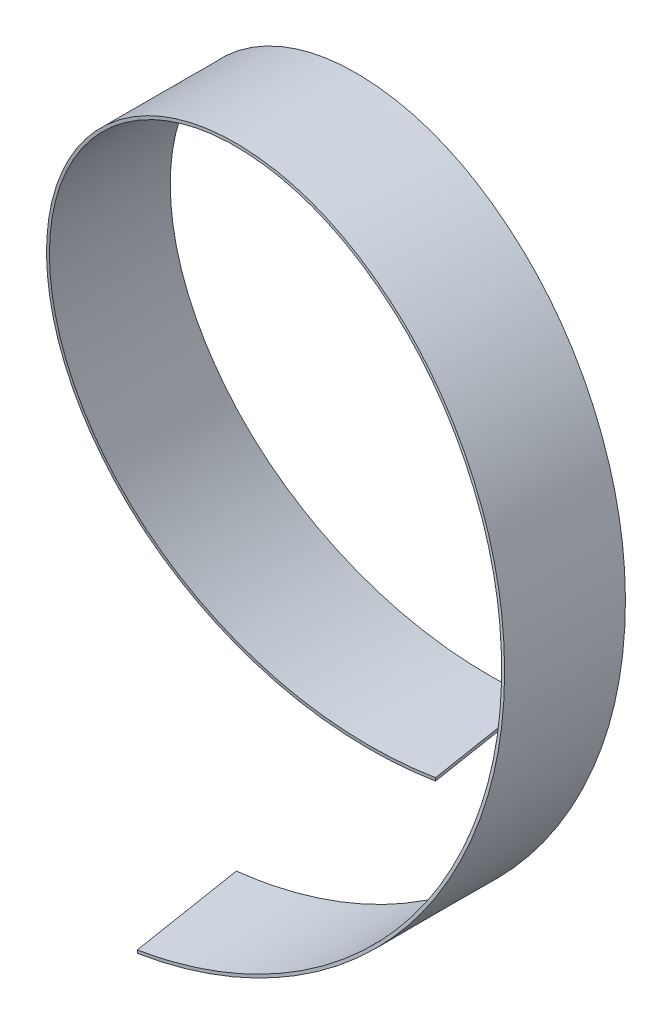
ISO-10303-21;
HEADER;
FILE_DESCRIPTION(('STEP AP214'),'2;1');
FILE_NAME('part.step','',(''),(''),'','','');
FILE_SCHEMA(('AUTOMOTIVE_DESIGN { 1 0 10303 214 1 1 1 1 }'));
ENDSEC;
DATA;
#1=APPLICATION_CONTEXT('core data for automotive mechanical design processes');
#2=APPLICATION_PROTOCOL_DEFINITION('international standard','automotive_design',2000,#1);
#3=PRODUCT_CONTEXT('',#1,'mechanical');
#4=PRODUCT('Part','Part','',(#3));
#5=PRODUCT_RELATED_PRODUCT_CATEGORY('part','',(#4));
#6=PRODUCT_DEFINITION_FORMATION('','',#4);
#7=PRODUCT_DEFINITION_CONTEXT('part definition',#1,'design');
#8=PRODUCT_DEFINITION('design','',#6,#7);
#9=PRODUCT_DEFINITION_SHAPE('','',#8);
#10=(LENGTH_UNIT() NAMED_UNIT(*) SI_UNIT(.MILLI.,.METRE.));
#11=(NAMED_UNIT(*) PLANE_ANGLE_UNIT() SI_UNIT($,.RADIAN.));
#12=(NAMED_UNIT(*) SI_UNIT($,.STERADIAN.) SOLID_ANGLE_UNIT());
#13=UNCERTAINTY_MEASURE_WITH_UNIT(LENGTH_MEASURE(1.E-05),#10,'distance_accuracy_value','');
#14=(GEOMETRIC_REPRESENTATION_CONTEXT(3) GLOBAL_UNCERTAINTY_ASSIGNED_CONTEXT((#13)) GLOBAL_UNIT_ASSIGNED_CONTEXT((#10,
#11,#12)) REPRESENTATION_CONTEXT('',''));
#15=CARTESIAN_POINT('',(0.,0.,0.));
#16=DIRECTION('',(0.,0.,1.));
#17=DIRECTION('',(1.,0.,0.));
#18=AXIS2_PLACEMENT_3D('',#15,#16,#17);
#19=CARTESIAN_POINT('',(1.5717672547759,-49.75,9.87570492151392));
#20=DIRECTION('',(0.987570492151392,0.,-0.15717672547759));
#21=DIRECTION('',(-0.15717672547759,0.,-0.987570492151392));
#22=AXIS2_PLACEMENT_3D('',#19,#20,#21);
#23=PLANE('',#22);
#24=DIRECTION('',(0.,-1.,0.));
#25=VECTOR('',#24,1.);
#26=CARTESIAN_POINT('',(1.5717672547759,-49.75,9.87570492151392));
#27=LINE('',#26,#25);
#28=CARTESIAN_POINT('',(1.5717672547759,-49.75,9.87570492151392));
#29=VERTEX_POINT('',#28);
#30=CARTESIAN_POINT('',(1.5717672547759,-50.25,9.87570492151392));
#31=VERTEX_POINT('',#30);
#32=EDGE_CURVE('E84',#29,#31,#27,.T.);
#33=ORIENTED_EDGE('',*,*,#32,.T.);
#34=DIRECTION('',(-0.15717672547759,0.,-0.987570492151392));
#35=VECTOR('',#34,1.);
#36=CARTESIAN_POINT('',(1.5717672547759,-50.25,9.87570492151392));
#37=LINE('',#36,#35);
#38=CARTESIAN_POINT('',(-1.5717672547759,-50.25,-9.87570492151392));
#39=VERTEX_POINT('',#38);
#40=EDGE_CURVE('E77',#31,#39,#37,.T.);
#41=ORIENTED_EDGE('',*,*,#40,.T.);
#42=DIRECTION('',(0.,1.,0.));
#43=VECTOR('',#42,1.);
#44=CARTESIAN_POINT('',(-1.5717672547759,-49.75,-9.87570492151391));
#45=LINE('',#44,#43);
#46=CARTESIAN_POINT('',(-1.5717672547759,-49.75,-9.87570492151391));
#47=VERTEX_POINT('',#46);
#48=EDGE_CURVE('E72',#39,#47,#45,.T.);
#49=ORIENTED_EDGE('',*,*,#48,.T.);
#50=DIRECTION('',(0.15717672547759,0.,0.987570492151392));
#51=VECTOR('',#50,1.);
#52=CARTESIAN_POINT('',(1.5717672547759,-49.75,9.87570492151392));
#53=LINE('',#52,#51);
#54=EDGE_CURVE('E67',#47,#29,#53,.T.);
#55=ORIENTED_EDGE('',*,*,#54,.T.);
#56=EDGE_LOOP('',(#33,#41,#49,#55));
#57=FACE_BOUND('',#56,.T.);
#58=ADVANCED_FACE('F32',(#57),#23,.T.);
#59=CARTESIAN_POINT('',(1.57176725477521,-49.75,59.8757049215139));
#60=DIRECTION('',(0.987570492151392,0.,-0.15717672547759));
#61=DIRECTION('',(-0.15717672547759,0.,-0.987570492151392));
#62=AXIS2_PLACEMENT_3D('',#59,#60,#61);
#63=PLANE('',#62);
#64=DIRECTION('',(0.,-1.,0.));
#65=VECTOR('',#64,1.);
#66=CARTESIAN_POINT('',(1.57176725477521,-49.75,59.8757049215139));
#67=LINE('',#66,#65);
#68=CARTESIAN_POINT('',(1.57176725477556,-49.75,59.8757049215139));
#69=VERTEX_POINT('',#68);
#70=CARTESIAN_POINT('',(1.57176725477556,-50.25,59.8757049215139));
#71=VERTEX_POINT('',#70);
#72=EDGE_CURVE('E92',#69,#71,#67,.T.);
#73=ORIENTED_EDGE('',*,*,#72,.F.);
#74=DIRECTION('',(0.15717672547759,0.,0.987570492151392));
#75=VECTOR('',#74,1.);
#76=CARTESIAN_POINT('',(1.57176725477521,-49.75,59.8757049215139));
#77=LINE('',#76,#75);
#78=CARTESIAN_POINT('',(-1.57176725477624,-49.75,40.124295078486));
#79=VERTEX_POINT('',#78);
#80=EDGE_CURVE('E11',#79,#69,#77,.T.);
#81=ORIENTED_EDGE('',*,*,#80,.F.);
#82=DIRECTION('',(0.,1.,0.));
#83=VECTOR('',#82,1.);
#84=CARTESIAN_POINT('',(-1.5717672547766,-49.75,40.1242950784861));
#85=LINE('',#84,#83);
#86=CARTESIAN_POINT('',(-1.57176725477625,-50.25,40.124295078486));
#87=VERTEX_POINT('',#86);
#88=EDGE_CURVE('E46',#87,#79,#85,.T.);
#89=ORIENTED_EDGE('',*,*,#88,.F.);
#90=DIRECTION('',(-0.15717672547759,0.,-0.987570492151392));
#91=VECTOR('',#90,1.);
#92=CARTESIAN_POINT('',(1.5717672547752,-50.25,59.8757049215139));
#93=LINE('',#92,#91);
#94=EDGE_CURVE('E55',#71,#87,#93,.T.);
#95=ORIENTED_EDGE('',*,*,#94,.F.);
#96=EDGE_LOOP('',(#73,#81,#89,#95));
#97=FACE_BOUND('',#96,.T.);
#98=ADVANCED_FACE('F146',(#97),#63,.F.);
#99=CARTESIAN_POINT('',(1.5717672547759,-49.75,9.87570492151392));
#100=CARTESIAN_POINT('',(-11.7587050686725,-50.1711537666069,11.9590382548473));
#101=CARTESIAN_POINT('',(-23.5138096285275,-43.8706474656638,14.0423715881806));
#102=CARTESIAN_POINT('',(-35.2689141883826,-37.5701411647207,16.1257049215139));
#103=CARTESIAN_POINT('',(-42.2988802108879,-26.2361903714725,18.2090382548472));
#104=CARTESIAN_POINT('',(-49.3288462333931,-14.9022395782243,20.2923715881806));
#105=CARTESIAN_POINT('',(-49.75,-1.57176725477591,22.3757049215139));
#106=CARTESIAN_POINT('',(-50.1711537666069,11.7587050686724,24.4590382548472));
#107=CARTESIAN_POINT('',(-43.8706474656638,23.5138096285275,26.5423715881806));
#108=CARTESIAN_POINT('',(-37.5701411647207,35.2689141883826,28.6257049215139));
#109=CARTESIAN_POINT('',(-26.2361903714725,42.2988802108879,30.7090382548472));
#110=CARTESIAN_POINT('',(-14.9022395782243,49.3288462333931,32.7923715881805));
#111=CARTESIAN_POINT('',(-1.57176725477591,49.75,34.8757049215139));
#112=CARTESIAN_POINT('',(11.7587050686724,50.1711537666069,36.9590382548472));
#113=CARTESIAN_POINT('',(23.5138096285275,43.8706474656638,39.0423715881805));
#114=CARTESIAN_POINT('',(35.2689141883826,37.5701411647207,41.1257049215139));
#115=CARTESIAN_POINT('',(42.2988802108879,26.2361903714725,43.2090382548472));
#116=CARTESIAN_POINT('',(49.3288462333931,14.9022395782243,45.2923715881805));
#117=CARTESIAN_POINT('',(49.75,1.57176725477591,47.3757049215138));
#118=CARTESIAN_POINT('',(50.1711537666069,-11.7587050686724,49.4590382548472));
#119=CARTESIAN_POINT('',(43.8706474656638,-23.5138096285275,51.5423715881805));
#120=CARTESIAN_POINT('',(37.5701411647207,-35.2689141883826,53.6257049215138));
#121=CARTESIAN_POINT('',(26.2361903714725,-42.2988802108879,55.7090382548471));
#122=CARTESIAN_POINT('',(14.9022395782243,-49.3288462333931,57.7923715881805));
#123=CARTESIAN_POINT('',(1.5717672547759,-49.75,59.8757049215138));
#124=CARTESIAN_POINT('',(1.5717672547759,-50.25,9.87570492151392));
#125=CARTESIAN_POINT('',(-11.892679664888,-50.6711537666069,11.9590382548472));
#126=CARTESIAN_POINT('',(-23.7638096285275,-44.303660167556,14.0423715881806));
#127=CARTESIAN_POINT('',(-35.6349395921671,-37.9361665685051,16.1257049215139));
#128=CARTESIAN_POINT('',(-42.7318929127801,-26.4861903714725,18.2090382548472));
#129=CARTESIAN_POINT('',(-49.8288462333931,-15.0362141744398,20.2923715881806));
#130=CARTESIAN_POINT('',(-50.25,-1.57176725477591,22.3757049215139));
#131=CARTESIAN_POINT('',(-50.6711537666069,11.892679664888,24.4590382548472));
#132=CARTESIAN_POINT('',(-44.303660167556,23.7638096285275,26.5423715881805));
#133=CARTESIAN_POINT('',(-37.9361665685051,35.6349395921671,28.6257049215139));
#134=CARTESIAN_POINT('',(-26.4861903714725,42.7318929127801,30.7090382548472));
#135=CARTESIAN_POINT('',(-15.0362141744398,49.8288462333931,32.7923715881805));
#136=CARTESIAN_POINT('',(-1.57176725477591,50.25,34.8757049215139));
#137=CARTESIAN_POINT('',(11.892679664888,50.6711537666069,36.9590382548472));
#138=CARTESIAN_POINT('',(23.7638096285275,44.303660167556,39.0423715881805));
#139=CARTESIAN_POINT('',(35.6349395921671,37.9361665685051,41.1257049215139));
#140=CARTESIAN_POINT('',(42.7318929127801,26.4861903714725,43.2090382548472));
#141=CARTESIAN_POINT('',(49.8288462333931,15.0362141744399,45.2923715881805));
#142=CARTESIAN_POINT('',(50.25,1.57176725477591,47.3757049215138));
#143=CARTESIAN_POINT('',(50.6711537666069,-11.892679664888,49.4590382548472));
#144=CARTESIAN_POINT('',(44.303660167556,-23.7638096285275,51.5423715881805));
#145=CARTESIAN_POINT('',(37.9361665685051,-35.6349395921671,53.6257049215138));
#146=CARTESIAN_POINT('',(26.4861903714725,-42.7318929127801,55.7090382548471));
#147=CARTESIAN_POINT('',(15.0362141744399,-49.8288462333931,57.7923715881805));
#148=CARTESIAN_POINT('',(1.5717672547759,-50.25,59.8757049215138));
#149=(BOUNDED_SURFACE() B_SPLINE_SURFACE(1,2,((#99,#100,#101,#102,#103,#104,#105,#106,#107,#108,
#109,#110,#111,#112,#113,#114,#115,#116,#117,#118,#119,#120,#121,#122,#123),(#124,#125,#126,
#127,#128,#129,#130,#131,#132,#133,#134,#135,#136,#137,#138,#139,#140,#141,#142,#143,#144,#145,
#146,#147,#148)),.UNSPECIFIED.,.F.,.F.,.F.) B_SPLINE_SURFACE_WITH_KNOTS((2,2),(3,2,2,2,2,2,2,2,
2,2,2,2,3),(0.,1.),(0.,0.0833333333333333,0.166666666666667,0.25,0.333333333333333,
0.416666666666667,0.5,0.583333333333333,0.666666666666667,0.75,0.833333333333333,
0.916666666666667,1.),
.UNSPECIFIED.) GEOMETRIC_REPRESENTATION_ITEM() RATIONAL_B_SPLINE_SURFACE(((1.,0.965925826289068,
1.,0.965925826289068,1.,0.965925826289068,1.,0.965925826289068,1.,0.965925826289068,1.,
0.965925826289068,1.,0.965925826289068,1.,0.965925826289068,1.,0.965925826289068,1.,
0.965925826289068,1.,0.965925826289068,1.,0.965925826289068,1.),(1.,0.965925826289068,1.,
0.965925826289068,1.,0.965925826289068,1.,0.965925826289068,1.,0.965925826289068,1.,
0.965925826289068,1.,0.965925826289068,1.,0.965925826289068,1.,0.965925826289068,1.,
0.965925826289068,1.,0.965925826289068,1.,0.965925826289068,1.))) REPRESENTATION_ITEM('') SURFACE());
#150=CARTESIAN_POINT('',(1.5717672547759,-50.25,9.87570492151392));
#151=CARTESIAN_POINT('',(-11.892679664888,-50.6711537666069,11.9590382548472));
#152=CARTESIAN_POINT('',(-23.7638096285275,-44.303660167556,14.0423715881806));
#153=CARTESIAN_POINT('',(-35.6349395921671,-37.9361665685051,16.1257049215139));
#154=CARTESIAN_POINT('',(-42.7318929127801,-26.4861903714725,18.2090382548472));
#155=CARTESIAN_POINT('',(-49.8288462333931,-15.0362141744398,20.2923715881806));
#156=CARTESIAN_POINT('',(-50.25,-1.57176725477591,22.3757049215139));
#157=CARTESIAN_POINT('',(-50.6711537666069,11.892679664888,24.4590382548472));
#158=CARTESIAN_POINT('',(-44.303660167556,23.7638096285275,26.5423715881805));
#159=CARTESIAN_POINT('',(-37.9361665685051,35.6349395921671,28.6257049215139));
#160=CARTESIAN_POINT('',(-26.4861903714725,42.7318929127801,30.7090382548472));
#161=CARTESIAN_POINT('',(-15.0362141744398,49.8288462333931,32.7923715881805));
#162=CARTESIAN_POINT('',(-1.57176725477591,50.25,34.8757049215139));
#163=CARTESIAN_POINT('',(11.892679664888,50.6711537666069,36.9590382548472));
#164=CARTESIAN_POINT('',(23.7638096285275,44.303660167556,39.0423715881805));
#165=CARTESIAN_POINT('',(35.6349395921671,37.9361665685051,41.1257049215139));
#166=CARTESIAN_POINT('',(42.7318929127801,26.4861903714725,43.2090382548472));
#167=CARTESIAN_POINT('',(49.8288462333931,15.0362141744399,45.2923715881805));
#168=CARTESIAN_POINT('',(50.25,1.57176725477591,47.3757049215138));
#169=CARTESIAN_POINT('',(50.6711537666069,-11.892679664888,49.4590382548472));
#170=CARTESIAN_POINT('',(44.303660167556,-23.7638096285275,51.5423715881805));
#171=CARTESIAN_POINT('',(37.9361665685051,-35.6349395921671,53.6257049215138));
#172=CARTESIAN_POINT('',(26.4861903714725,-42.7318929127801,55.7090382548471));
#173=CARTESIAN_POINT('',(15.0362141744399,-49.8288462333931,57.7923715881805));
#174=CARTESIAN_POINT('',(1.57176725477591,-50.25,59.8757049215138));
#175=(BOUNDED_CURVE() B_SPLINE_CURVE(2,(#150,#151,#152,#153,#154,#155,#156,#157,#158,#159,#160,
#161,#162,#163,#164,#165,#166,#167,#168,#169,#170,#171,#172,#173,#174),.UNSPECIFIED.,.F.,
.F.) B_SPLINE_CURVE_WITH_KNOTS((3,2,2,2,2,2,2,2,2,2,2,2,3),(0.,0.0833333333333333,
0.166666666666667,0.25,0.333333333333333,0.416666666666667,0.5,0.583333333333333,
0.666666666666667,0.75,0.833333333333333,0.916666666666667,1.),
.UNSPECIFIED.) CURVE() GEOMETRIC_REPRESENTATION_ITEM() RATIONAL_B_SPLINE_CURVE((1.,
0.965925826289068,1.,0.965925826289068,1.,0.965925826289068,1.,0.965925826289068,1.,
0.965925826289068,1.,0.965925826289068,1.,0.965925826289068,1.,0.965925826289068,1.,
0.965925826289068,1.,0.965925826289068,1.,0.965925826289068,1.,0.965925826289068,1.)) REPRESENTATION_ITEM(''));
#176=EDGE_CURVE('E87',#31,#71,#175,.T.);
#177=CARTESIAN_POINT('',(1.5717672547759,-49.75,9.87570492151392));
#178=CARTESIAN_POINT('',(-11.7587050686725,-50.1711537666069,11.9590382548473));
#179=CARTESIAN_POINT('',(-23.5138096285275,-43.8706474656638,14.0423715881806));
#180=CARTESIAN_POINT('',(-35.2689141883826,-37.5701411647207,16.1257049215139));
#181=CARTESIAN_POINT('',(-42.2988802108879,-26.2361903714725,18.2090382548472));
#182=CARTESIAN_POINT('',(-49.3288462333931,-14.9022395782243,20.2923715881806));
#183=CARTESIAN_POINT('',(-49.75,-1.57176725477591,22.3757049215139));
#184=CARTESIAN_POINT('',(-50.1711537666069,11.7587050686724,24.4590382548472));
#185=CARTESIAN_POINT('',(-43.8706474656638,23.5138096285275,26.5423715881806));
#186=CARTESIAN_POINT('',(-37.5701411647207,35.2689141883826,28.6257049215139));
#187=CARTESIAN_POINT('',(-26.2361903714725,42.2988802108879,30.7090382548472));
#188=CARTESIAN_POINT('',(-14.9022395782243,49.3288462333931,32.7923715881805));
#189=CARTESIAN_POINT('',(-1.57176725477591,49.75,34.8757049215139));
#190=CARTESIAN_POINT('',(11.7587050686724,50.1711537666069,36.9590382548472));
#191=CARTESIAN_POINT('',(23.5138096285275,43.8706474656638,39.0423715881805));
#192=CARTESIAN_POINT('',(35.2689141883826,37.5701411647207,41.1257049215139));
#193=CARTESIAN_POINT('',(42.2988802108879,26.2361903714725,43.2090382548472));
#194=CARTESIAN_POINT('',(49.3288462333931,14.9022395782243,45.2923715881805));
#195=CARTESIAN_POINT('',(49.75,1.57176725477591,47.3757049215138));
#196=CARTESIAN_POINT('',(50.1711537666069,-11.7587050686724,49.4590382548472));
#197=CARTESIAN_POINT('',(43.8706474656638,-23.5138096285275,51.5423715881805));
#198=CARTESIAN_POINT('',(37.5701411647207,-35.2689141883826,53.6257049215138));
#199=CARTESIAN_POINT('',(26.2361903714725,-42.2988802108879,55.7090382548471));
#200=CARTESIAN_POINT('',(14.9022395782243,-49.3288462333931,57.7923715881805));
#201=CARTESIAN_POINT('',(1.57176725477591,-49.75,59.8757049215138));
#202=(BOUNDED_CURVE() B_SPLINE_CURVE(2,(#177,#178,#179,#180,#181,#182,#183,#184,#185,#186,#187,
#188,#189,#190,#191,#192,#193,#194,#195,#196,#197,#198,#199,#200,#201),.UNSPECIFIED.,.F.,
.F.) B_SPLINE_CURVE_WITH_KNOTS((3,2,2,2,2,2,2,2,2,2,2,2,3),(0.,0.0833333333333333,
0.166666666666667,0.25,0.333333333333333,0.416666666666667,0.5,0.583333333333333,
0.666666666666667,0.75,0.833333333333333,0.916666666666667,1.),
.UNSPECIFIED.) CURVE() GEOMETRIC_REPRESENTATION_ITEM() RATIONAL_B_SPLINE_CURVE((1.,
0.965925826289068,1.,0.965925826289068,1.,0.965925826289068,1.,0.965925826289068,1.,
0.965925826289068,1.,0.965925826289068,1.,0.965925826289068,1.,0.965925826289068,1.,
0.965925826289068,1.,0.965925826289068,1.,0.965925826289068,1.,0.965925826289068,1.)) REPRESENTATION_ITEM(''));
#203=EDGE_CURVE('E86',#29,#69,#202,.T.);
#204=ORIENTED_EDGE('',*,*,#176,.F.);
#205=ORIENTED_EDGE('',*,*,#32,.F.);
#206=ORIENTED_EDGE('',*,*,#203,.T.);
#207=ORIENTED_EDGE('',*,*,#72,.T.);
#208=EDGE_LOOP('',(#204,#205,#206,#207));
#209=FACE_BOUND('',#208,.T.);
#210=ADVANCED_FACE('F85',(#209),#149,.F.);
#211=CARTESIAN_POINT('',(1.5717672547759,-50.25,9.87570492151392));
#212=CARTESIAN_POINT('',(-11.892679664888,-50.6711537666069,11.9590382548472));
#213=CARTESIAN_POINT('',(-23.7638096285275,-44.303660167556,14.0423715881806));
#214=CARTESIAN_POINT('',(-35.6349395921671,-37.9361665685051,16.1257049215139));
#215=CARTESIAN_POINT('',(-42.7318929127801,-26.4861903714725,18.2090382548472));
#216=CARTESIAN_POINT('',(-49.8288462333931,-15.0362141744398,20.2923715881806));
#217=CARTESIAN_POINT('',(-50.25,-1.57176725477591,22.3757049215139));
#218=CARTESIAN_POINT('',(-50.6711537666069,11.892679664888,24.4590382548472));
#219=CARTESIAN_POINT('',(-44.303660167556,23.7638096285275,26.5423715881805));
#220=CARTESIAN_POINT('',(-37.9361665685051,35.6349395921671,28.6257049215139));
#221=CARTESIAN_POINT('',(-26.4861903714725,42.7318929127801,30.7090382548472));
#222=CARTESIAN_POINT('',(-15.0362141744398,49.8288462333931,32.7923715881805));
#223=CARTESIAN_POINT('',(-1.57176725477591,50.25,34.8757049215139));
#224=CARTESIAN_POINT('',(11.892679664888,50.6711537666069,36.9590382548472));
#225=CARTESIAN_POINT('',(23.7638096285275,44.303660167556,39.0423715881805));
#226=CARTESIAN_POINT('',(35.6349395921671,37.9361665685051,41.1257049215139));
#227=CARTESIAN_POINT('',(42.7318929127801,26.4861903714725,43.2090382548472));
#228=CARTESIAN_POINT('',(49.8288462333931,15.0362141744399,45.2923715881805));
#229=CARTESIAN_POINT('',(50.25,1.57176725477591,47.3757049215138));
#230=CARTESIAN_POINT('',(50.6711537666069,-11.892679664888,49.4590382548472));
#231=CARTESIAN_POINT('',(44.303660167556,-23.7638096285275,51.5423715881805));
#232=CARTESIAN_POINT('',(37.9361665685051,-35.6349395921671,53.6257049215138));
#233=CARTESIAN_POINT('',(26.4861903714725,-42.7318929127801,55.7090382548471));
#234=CARTESIAN_POINT('',(15.0362141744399,-49.8288462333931,57.7923715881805));
#235=CARTESIAN_POINT('',(1.5717672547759,-50.25,59.8757049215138));
#236=CARTESIAN_POINT('',(-1.5717672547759,-50.25,-9.87570492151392));
#237=CARTESIAN_POINT('',(-15.0362141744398,-49.8288462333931,-7.79237158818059));
#238=CARTESIAN_POINT('',(-26.4861903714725,-42.7318929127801,-5.70903825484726));
#239=CARTESIAN_POINT('',(-37.9361665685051,-35.6349395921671,-3.62570492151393));
#240=CARTESIAN_POINT('',(-44.303660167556,-23.7638096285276,-1.54237158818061));
#241=CARTESIAN_POINT('',(-50.6711537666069,-11.892679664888,0.540961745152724));
#242=CARTESIAN_POINT('',(-50.25,1.5717672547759,2.62429507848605));
#243=CARTESIAN_POINT('',(-49.8288462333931,15.0362141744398,4.70762841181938));
#244=CARTESIAN_POINT('',(-42.7318929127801,26.4861903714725,6.79096174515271));
#245=CARTESIAN_POINT('',(-35.6349395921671,37.9361665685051,8.87429507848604));
#246=CARTESIAN_POINT('',(-23.7638096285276,44.303660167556,10.9576284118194));
#247=CARTESIAN_POINT('',(-11.892679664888,50.6711537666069,13.0409617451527));
#248=CARTESIAN_POINT('',(1.5717672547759,50.25,15.124295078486));
#249=CARTESIAN_POINT('',(15.0362141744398,49.8288462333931,17.2076284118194));
#250=CARTESIAN_POINT('',(26.4861903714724,42.7318929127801,19.2909617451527));
#251=CARTESIAN_POINT('',(37.9361665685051,35.6349395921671,21.374295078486));
#252=CARTESIAN_POINT('',(44.303660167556,23.7638096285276,23.4576284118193));
#253=CARTESIAN_POINT('',(50.6711537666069,11.8926796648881,25.5409617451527));
#254=CARTESIAN_POINT('',(50.25,-1.57176725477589,27.624295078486));
#255=CARTESIAN_POINT('',(49.8288462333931,-15.0362141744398,29.7076284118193));
#256=CARTESIAN_POINT('',(42.7318929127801,-26.4861903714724,31.7909617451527));
#257=CARTESIAN_POINT('',(35.6349395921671,-37.9361665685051,33.874295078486));
#258=CARTESIAN_POINT('',(23.7638096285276,-44.303660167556,35.9576284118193));
#259=CARTESIAN_POINT('',(11.8926796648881,-50.6711537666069,38.0409617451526));
#260=CARTESIAN_POINT('',(-1.5717672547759,-50.25,40.124295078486));
#261=(BOUNDED_SURFACE() B_SPLINE_SURFACE(1,2,((#211,#212,#213,#214,#215,#216,#217,#218,#219,
#220,#221,#222,#223,#224,#225,#226,#227,#228,#229,#230,#231,#232,#233,#234,#235),(#236,#237,
#238,#239,#240,#241,#242,#243,#244,#245,#246,#247,#248,#249,#250,#251,#252,#253,#254,#255,#256,
#257,#258,#259,#260)),.UNSPECIFIED.,.F.,.F.,.F.) B_SPLINE_SURFACE_WITH_KNOTS((2,2),(3,2,2,2,2,2,
2,2,2,2,2,2,3),(0.,1.),(0.,0.0833333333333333,0.166666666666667,0.25,0.333333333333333,
0.416666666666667,0.5,0.583333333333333,0.666666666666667,0.75,0.833333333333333,
0.916666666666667,1.),
.UNSPECIFIED.) GEOMETRIC_REPRESENTATION_ITEM() RATIONAL_B_SPLINE_SURFACE(((1.,0.965925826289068,
1.,0.965925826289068,1.,0.965925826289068,1.,0.965925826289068,1.,0.965925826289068,1.,
0.965925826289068,1.,0.965925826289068,1.,0.965925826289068,1.,0.965925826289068,1.,
0.965925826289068,1.,0.965925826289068,1.,0.965925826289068,1.),(1.,0.965925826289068,1.,
0.965925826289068,1.,0.965925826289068,1.,0.965925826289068,1.,0.965925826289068,1.,
0.965925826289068,1.,0.965925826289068,1.,0.965925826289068,1.,0.965925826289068,1.,
0.965925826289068,1.,0.965925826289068,1.,0.965925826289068,1.))) REPRESENTATION_ITEM('') SURFACE());
#262=CARTESIAN_POINT('',(-1.5717672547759,-50.25,-9.87570492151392));
#263=CARTESIAN_POINT('',(-15.0362141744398,-49.8288462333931,-7.79237158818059));
#264=CARTESIAN_POINT('',(-26.4861903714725,-42.7318929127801,-5.70903825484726));
#265=CARTESIAN_POINT('',(-37.9361665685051,-35.6349395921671,-3.62570492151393));
#266=CARTESIAN_POINT('',(-44.303660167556,-23.7638096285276,-1.5423715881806));
#267=CARTESIAN_POINT('',(-50.6711537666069,-11.892679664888,0.540961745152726));
#268=CARTESIAN_POINT('',(-50.25,1.5717672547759,2.62429507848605));
#269=CARTESIAN_POINT('',(-49.8288462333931,15.0362141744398,4.70762841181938));
#270=CARTESIAN_POINT('',(-42.7318929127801,26.4861903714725,6.79096174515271));
#271=CARTESIAN_POINT('',(-35.6349395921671,37.9361665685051,8.87429507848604));
#272=CARTESIAN_POINT('',(-23.7638096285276,44.303660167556,10.9576284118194));
#273=CARTESIAN_POINT('',(-11.892679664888,50.6711537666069,13.0409617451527));
#274=CARTESIAN_POINT('',(1.5717672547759,50.25,15.124295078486));
#275=CARTESIAN_POINT('',(15.0362141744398,49.8288462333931,17.2076284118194));
#276=CARTESIAN_POINT('',(26.4861903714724,42.7318929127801,19.2909617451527));
#277=CARTESIAN_POINT('',(37.9361665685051,35.6349395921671,21.374295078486));
#278=CARTESIAN_POINT('',(44.303660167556,23.7638096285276,23.4576284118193));
#279=CARTESIAN_POINT('',(50.6711537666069,11.8926796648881,25.5409617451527));
#280=CARTESIAN_POINT('',(50.25,-1.57176725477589,27.624295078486));
#281=CARTESIAN_POINT('',(49.8288462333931,-15.0362141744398,29.7076284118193));
#282=CARTESIAN_POINT('',(42.7318929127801,-26.4861903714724,31.7909617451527));
#283=CARTESIAN_POINT('',(35.6349395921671,-37.9361665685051,33.874295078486));
#284=CARTESIAN_POINT('',(23.7638096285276,-44.303660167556,35.9576284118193));
#285=CARTESIAN_POINT('',(11.8926796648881,-50.6711537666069,38.0409617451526));
#286=CARTESIAN_POINT('',(-1.57176725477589,-50.25,40.124295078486));
#287=(BOUNDED_CURVE() B_SPLINE_CURVE(2,(#262,#263,#264,#265,#266,#267,#268,#269,#270,#271,#272,
#273,#274,#275,#276,#277,#278,#279,#280,#281,#282,#283,#284,#285,#286),.UNSPECIFIED.,.F.,
.F.) B_SPLINE_CURVE_WITH_KNOTS((3,2,2,2,2,2,2,2,2,2,2,2,3),(0.,0.0833333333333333,
0.166666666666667,0.25,0.333333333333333,0.416666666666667,0.5,0.583333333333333,
0.666666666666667,0.75,0.833333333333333,0.916666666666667,1.),
.UNSPECIFIED.) CURVE() GEOMETRIC_REPRESENTATION_ITEM() RATIONAL_B_SPLINE_CURVE((1.,
0.965925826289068,1.,0.965925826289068,1.,0.965925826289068,1.,0.965925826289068,1.,
0.965925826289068,1.,0.965925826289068,1.,0.965925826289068,1.,0.965925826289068,1.,
0.965925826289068,1.,0.965925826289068,1.,0.965925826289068,1.,0.965925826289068,1.)) REPRESENTATION_ITEM(''));
#288=EDGE_CURVE('E107',#39,#87,#287,.T.);
#289=ORIENTED_EDGE('',*,*,#288,.F.);
#290=ORIENTED_EDGE('',*,*,#40,.F.);
#291=ORIENTED_EDGE('',*,*,#176,.T.);
#292=ORIENTED_EDGE('',*,*,#94,.T.);
#293=EDGE_LOOP('',(#289,#290,#291,#292));
#294=FACE_BOUND('',#293,.T.);
#295=ADVANCED_FACE('F125',(#294),#261,.F.);
#296=CARTESIAN_POINT('',(-1.5717672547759,-50.25,-9.87570492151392));
#297=CARTESIAN_POINT('',(-15.0362141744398,-49.8288462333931,-7.79237158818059));
#298=CARTESIAN_POINT('',(-26.4861903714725,-42.7318929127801,-5.70903825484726));
#299=CARTESIAN_POINT('',(-37.9361665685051,-35.6349395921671,-3.62570492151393));
#300=CARTESIAN_POINT('',(-44.303660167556,-23.7638096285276,-1.5423715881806));
#301=CARTESIAN_POINT('',(-50.6711537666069,-11.892679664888,0.540961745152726));
#302=CARTESIAN_POINT('',(-50.25,1.5717672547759,2.62429507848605));
#303=CARTESIAN_POINT('',(-49.8288462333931,15.0362141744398,4.70762841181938));
#304=CARTESIAN_POINT('',(-42.7318929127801,26.4861903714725,6.79096174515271));
#305=CARTESIAN_POINT('',(-35.6349395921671,37.9361665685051,8.87429507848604));
#306=CARTESIAN_POINT('',(-23.7638096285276,44.303660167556,10.9576284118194));
#307=CARTESIAN_POINT('',(-11.892679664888,50.6711537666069,13.0409617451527));
#308=CARTESIAN_POINT('',(1.5717672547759,50.25,15.124295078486));
#309=CARTESIAN_POINT('',(15.0362141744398,49.8288462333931,17.2076284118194));
#310=CARTESIAN_POINT('',(26.4861903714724,42.7318929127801,19.2909617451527));
#311=CARTESIAN_POINT('',(37.9361665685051,35.6349395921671,21.374295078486));
#312=CARTESIAN_POINT('',(44.303660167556,23.7638096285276,23.4576284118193));
#313=CARTESIAN_POINT('',(50.6711537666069,11.8926796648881,25.5409617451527));
#314=CARTESIAN_POINT('',(50.25,-1.57176725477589,27.624295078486));
#315=CARTESIAN_POINT('',(49.8288462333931,-15.0362141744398,29.7076284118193));
#316=CARTESIAN_POINT('',(42.7318929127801,-26.4861903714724,31.7909617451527));
#317=CARTESIAN_POINT('',(35.6349395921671,-37.9361665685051,33.874295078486));
#318=CARTESIAN_POINT('',(23.7638096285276,-44.303660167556,35.9576284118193));
#319=CARTESIAN_POINT('',(11.8926796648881,-50.6711537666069,38.0409617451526));
#320=CARTESIAN_POINT('',(-1.5717672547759,-50.25,40.124295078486));
#321=CARTESIAN_POINT('',(-1.5717672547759,-49.75,-9.87570492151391));
#322=CARTESIAN_POINT('',(-14.9022395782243,-49.3288462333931,-7.79237158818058));
#323=CARTESIAN_POINT('',(-26.2361903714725,-42.2988802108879,-5.70903825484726));
#324=CARTESIAN_POINT('',(-37.5701411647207,-35.2689141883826,-3.62570492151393));
#325=CARTESIAN_POINT('',(-43.8706474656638,-23.5138096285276,-1.5423715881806));
#326=CARTESIAN_POINT('',(-50.1711537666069,-11.7587050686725,0.540961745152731));
#327=CARTESIAN_POINT('',(-49.75,1.5717672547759,2.62429507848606));
#328=CARTESIAN_POINT('',(-49.3288462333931,14.9022395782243,4.70762841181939));
#329=CARTESIAN_POINT('',(-42.2988802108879,26.2361903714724,6.79096174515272));
#330=CARTESIAN_POINT('',(-35.2689141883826,37.5701411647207,8.87429507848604));
#331=CARTESIAN_POINT('',(-23.5138096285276,43.8706474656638,10.9576284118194));
#332=CARTESIAN_POINT('',(-11.7587050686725,50.1711537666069,13.0409617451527));
#333=CARTESIAN_POINT('',(1.57176725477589,49.75,15.124295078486));
#334=CARTESIAN_POINT('',(14.9022395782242,49.3288462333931,17.2076284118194));
#335=CARTESIAN_POINT('',(26.2361903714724,42.2988802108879,19.2909617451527));
#336=CARTESIAN_POINT('',(37.5701411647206,35.2689141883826,21.374295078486));
#337=CARTESIAN_POINT('',(43.8706474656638,23.5138096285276,23.4576284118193));
#338=CARTESIAN_POINT('',(50.1711537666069,11.7587050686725,25.5409617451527));
#339=CARTESIAN_POINT('',(49.75,-1.57176725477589,27.624295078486));
#340=CARTESIAN_POINT('',(49.3288462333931,-14.9022395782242,29.7076284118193));
#341=CARTESIAN_POINT('',(42.2988802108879,-26.2361903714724,31.7909617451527));
#342=CARTESIAN_POINT('',(35.2689141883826,-37.5701411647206,33.874295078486));
#343=CARTESIAN_POINT('',(23.5138096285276,-43.8706474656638,35.9576284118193));
#344=CARTESIAN_POINT('',(11.7587050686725,-50.1711537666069,38.0409617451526));
#345=CARTESIAN_POINT('',(-1.5717672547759,-49.75,40.124295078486));
#346=(BOUNDED_SURFACE() B_SPLINE_SURFACE(1,2,((#296,#297,#298,#299,#300,#301,#302,#303,#304,
#305,#306,#307,#308,#309,#310,#311,#312,#313,#314,#315,#316,#317,#318,#319,#320),(#321,#322,
#323,#324,#325,#326,#327,#328,#329,#330,#331,#332,#333,#334,#335,#336,#337,#338,#339,#340,#341,
#342,#343,#344,#345)),.UNSPECIFIED.,.F.,.F.,.F.) B_SPLINE_SURFACE_WITH_KNOTS((2,2),(3,2,2,2,2,2,
2,2,2,2,2,2,3),(0.,1.),(0.,0.0833333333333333,0.166666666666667,0.25,0.333333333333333,
0.416666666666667,0.5,0.583333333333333,0.666666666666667,0.75,0.833333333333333,
0.916666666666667,1.),
.UNSPECIFIED.) GEOMETRIC_REPRESENTATION_ITEM() RATIONAL_B_SPLINE_SURFACE(((1.,0.965925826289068,
1.,0.965925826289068,1.,0.965925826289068,1.,0.965925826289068,1.,0.965925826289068,1.,
0.965925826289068,1.,0.965925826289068,1.,0.965925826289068,1.,0.965925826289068,1.,
0.965925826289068,1.,0.965925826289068,1.,0.965925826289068,1.),(1.,0.965925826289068,1.,
0.965925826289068,1.,0.965925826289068,1.,0.965925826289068,1.,0.965925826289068,1.,
0.965925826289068,1.,0.965925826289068,1.,0.965925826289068,1.,0.965925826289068,1.,
0.965925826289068,1.,0.965925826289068,1.,0.965925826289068,1.))) REPRESENTATION_ITEM('') SURFACE());
#347=CARTESIAN_POINT('',(-1.5717672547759,-49.75,-9.87570492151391));
#348=CARTESIAN_POINT('',(-14.9022395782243,-49.3288462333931,-7.79237158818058));
#349=CARTESIAN_POINT('',(-26.2361903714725,-42.2988802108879,-5.70903825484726));
#350=CARTESIAN_POINT('',(-37.5701411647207,-35.2689141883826,-3.62570492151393));
#351=CARTESIAN_POINT('',(-43.8706474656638,-23.5138096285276,-1.5423715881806));
#352=CARTESIAN_POINT('',(-50.1711537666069,-11.7587050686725,0.540961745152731));
#353=CARTESIAN_POINT('',(-49.75,1.5717672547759,2.62429507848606));
#354=CARTESIAN_POINT('',(-49.3288462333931,14.9022395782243,4.70762841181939));
#355=CARTESIAN_POINT('',(-42.2988802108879,26.2361903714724,6.79096174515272));
#356=CARTESIAN_POINT('',(-35.2689141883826,37.5701411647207,8.87429507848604));
#357=CARTESIAN_POINT('',(-23.5138096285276,43.8706474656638,10.9576284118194));
#358=CARTESIAN_POINT('',(-11.7587050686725,50.1711537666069,13.0409617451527));
#359=CARTESIAN_POINT('',(1.57176725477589,49.75,15.124295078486));
#360=CARTESIAN_POINT('',(14.9022395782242,49.3288462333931,17.2076284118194));
#361=CARTESIAN_POINT('',(26.2361903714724,42.2988802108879,19.2909617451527));
#362=CARTESIAN_POINT('',(37.5701411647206,35.2689141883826,21.374295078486));
#363=CARTESIAN_POINT('',(43.8706474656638,23.5138096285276,23.4576284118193));
#364=CARTESIAN_POINT('',(50.1711537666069,11.7587050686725,25.5409617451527));
#365=CARTESIAN_POINT('',(49.75,-1.57176725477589,27.624295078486));
#366=CARTESIAN_POINT('',(49.3288462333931,-14.9022395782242,29.7076284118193));
#367=CARTESIAN_POINT('',(42.2988802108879,-26.2361903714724,31.7909617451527));
#368=CARTESIAN_POINT('',(35.2689141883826,-37.5701411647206,33.874295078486));
#369=CARTESIAN_POINT('',(23.5138096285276,-43.8706474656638,35.9576284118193));
#370=CARTESIAN_POINT('',(11.7587050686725,-50.1711537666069,38.0409617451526));
#371=CARTESIAN_POINT('',(-1.57176725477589,-49.75,40.124295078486));
#372=(BOUNDED_CURVE() B_SPLINE_CURVE(2,(#347,#348,#349,#350,#351,#352,#353,#354,#355,#356,#357,
#358,#359,#360,#361,#362,#363,#364,#365,#366,#367,#368,#369,#370,#371),.UNSPECIFIED.,.F.,
.F.) B_SPLINE_CURVE_WITH_KNOTS((3,2,2,2,2,2,2,2,2,2,2,2,3),(0.,0.0833333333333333,
0.166666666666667,0.25,0.333333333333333,0.416666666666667,0.5,0.583333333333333,
0.666666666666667,0.75,0.833333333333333,0.916666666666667,1.),
.UNSPECIFIED.) CURVE() GEOMETRIC_REPRESENTATION_ITEM() RATIONAL_B_SPLINE_CURVE((1.,
0.965925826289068,1.,0.965925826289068,1.,0.965925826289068,1.,0.965925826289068,1.,
0.965925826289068,1.,0.965925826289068,1.,0.965925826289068,1.,0.965925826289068,1.,
0.965925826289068,1.,0.965925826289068,1.,0.965925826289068,1.,0.965925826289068,1.)) REPRESENTATION_ITEM(''));
#373=EDGE_CURVE('E39',#47,#79,#372,.T.);
#374=ORIENTED_EDGE('',*,*,#373,.F.);
#375=ORIENTED_EDGE('',*,*,#48,.F.);
#376=ORIENTED_EDGE('',*,*,#288,.T.);
#377=ORIENTED_EDGE('',*,*,#88,.T.);
#378=EDGE_LOOP('',(#374,#375,#376,#377));
#379=FACE_BOUND('',#378,.T.);
#380=ADVANCED_FACE('F123',(#379),#346,.F.);
#381=CARTESIAN_POINT('',(-1.5717672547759,-49.75,-9.87570492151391));
#382=CARTESIAN_POINT('',(-14.9022395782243,-49.3288462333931,-7.79237158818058));
#383=CARTESIAN_POINT('',(-26.2361903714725,-42.2988802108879,-5.70903825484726));
#384=CARTESIAN_POINT('',(-37.5701411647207,-35.2689141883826,-3.62570492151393));
#385=CARTESIAN_POINT('',(-43.8706474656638,-23.5138096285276,-1.5423715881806));
#386=CARTESIAN_POINT('',(-50.1711537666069,-11.7587050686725,0.540961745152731));
#387=CARTESIAN_POINT('',(-49.75,1.5717672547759,2.62429507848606));
#388=CARTESIAN_POINT('',(-49.3288462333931,14.9022395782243,4.70762841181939));
#389=CARTESIAN_POINT('',(-42.2988802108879,26.2361903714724,6.79096174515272));
#390=CARTESIAN_POINT('',(-35.2689141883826,37.5701411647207,8.87429507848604));
#391=CARTESIAN_POINT('',(-23.5138096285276,43.8706474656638,10.9576284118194));
#392=CARTESIAN_POINT('',(-11.7587050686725,50.1711537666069,13.0409617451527));
#393=CARTESIAN_POINT('',(1.57176725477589,49.75,15.124295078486));
#394=CARTESIAN_POINT('',(14.9022395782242,49.3288462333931,17.2076284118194));
#395=CARTESIAN_POINT('',(26.2361903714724,42.2988802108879,19.2909617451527));
#396=CARTESIAN_POINT('',(37.5701411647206,35.2689141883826,21.374295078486));
#397=CARTESIAN_POINT('',(43.8706474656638,23.5138096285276,23.4576284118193));
#398=CARTESIAN_POINT('',(50.1711537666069,11.7587050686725,25.5409617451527));
#399=CARTESIAN_POINT('',(49.75,-1.57176725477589,27.624295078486));
#400=CARTESIAN_POINT('',(49.3288462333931,-14.9022395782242,29.7076284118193));
#401=CARTESIAN_POINT('',(42.2988802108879,-26.2361903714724,31.7909617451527));
#402=CARTESIAN_POINT('',(35.2689141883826,-37.5701411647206,33.874295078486));
#403=CARTESIAN_POINT('',(23.5138096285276,-43.8706474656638,35.9576284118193));
#404=CARTESIAN_POINT('',(11.7587050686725,-50.1711537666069,38.0409617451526));
#405=CARTESIAN_POINT('',(-1.5717672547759,-49.75,40.124295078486));
#406=CARTESIAN_POINT('',(1.5717672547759,-49.75,9.87570492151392));
#407=CARTESIAN_POINT('',(-11.7587050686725,-50.1711537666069,11.9590382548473));
#408=CARTESIAN_POINT('',(-23.5138096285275,-43.8706474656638,14.0423715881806));
#409=CARTESIAN_POINT('',(-35.2689141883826,-37.5701411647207,16.1257049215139));
#410=CARTESIAN_POINT('',(-42.2988802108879,-26.2361903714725,18.2090382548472));
#411=CARTESIAN_POINT('',(-49.3288462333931,-14.9022395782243,20.2923715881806));
#412=CARTESIAN_POINT('',(-49.75,-1.57176725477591,22.3757049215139));
#413=CARTESIAN_POINT('',(-50.1711537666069,11.7587050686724,24.4590382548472));
#414=CARTESIAN_POINT('',(-43.8706474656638,23.5138096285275,26.5423715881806));
#415=CARTESIAN_POINT('',(-37.5701411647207,35.2689141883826,28.6257049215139));
#416=CARTESIAN_POINT('',(-26.2361903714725,42.2988802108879,30.7090382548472));
#417=CARTESIAN_POINT('',(-14.9022395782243,49.3288462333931,32.7923715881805));
#418=CARTESIAN_POINT('',(-1.57176725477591,49.75,34.8757049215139));
#419=CARTESIAN_POINT('',(11.7587050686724,50.1711537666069,36.9590382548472));
#420=CARTESIAN_POINT('',(23.5138096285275,43.8706474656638,39.0423715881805));
#421=CARTESIAN_POINT('',(35.2689141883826,37.5701411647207,41.1257049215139));
#422=CARTESIAN_POINT('',(42.2988802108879,26.2361903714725,43.2090382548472));
#423=CARTESIAN_POINT('',(49.3288462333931,14.9022395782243,45.2923715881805));
#424=CARTESIAN_POINT('',(49.75,1.57176725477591,47.3757049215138));
#425=CARTESIAN_POINT('',(50.1711537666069,-11.7587050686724,49.4590382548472));
#426=CARTESIAN_POINT('',(43.8706474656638,-23.5138096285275,51.5423715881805));
#427=CARTESIAN_POINT('',(37.5701411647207,-35.2689141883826,53.6257049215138));
#428=CARTESIAN_POINT('',(26.2361903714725,-42.2988802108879,55.7090382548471));
#429=CARTESIAN_POINT('',(14.9022395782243,-49.3288462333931,57.7923715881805));
#430=CARTESIAN_POINT('',(1.5717672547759,-49.75,59.8757049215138));
#431=(BOUNDED_SURFACE() B_SPLINE_SURFACE(1,2,((#381,#382,#383,#384,#385,#386,#387,#388,#389,
#390,#391,#392,#393,#394,#395,#396,#397,#398,#399,#400,#401,#402,#403,#404,#405),(#406,#407,
#408,#409,#410,#411,#412,#413,#414,#415,#416,#417,#418,#419,#420,#421,#422,#423,#424,#425,#426,
#427,#428,#429,#430)),.UNSPECIFIED.,.F.,.F.,.F.) B_SPLINE_SURFACE_WITH_KNOTS((2,2),(3,2,2,2,2,2,
2,2,2,2,2,2,3),(0.,1.),(0.,0.0833333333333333,0.166666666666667,0.25,0.333333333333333,
0.416666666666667,0.5,0.583333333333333,0.666666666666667,0.75,0.833333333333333,
0.916666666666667,1.),
.UNSPECIFIED.) GEOMETRIC_REPRESENTATION_ITEM() RATIONAL_B_SPLINE_SURFACE(((1.,0.965925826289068,
1.,0.965925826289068,1.,0.965925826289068,1.,0.965925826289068,1.,0.965925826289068,1.,
0.965925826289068,1.,0.965925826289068,1.,0.965925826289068,1.,0.965925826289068,1.,
0.965925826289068,1.,0.965925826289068,1.,0.965925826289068,1.),(1.,0.965925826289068,1.,
0.965925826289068,1.,0.965925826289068,1.,0.965925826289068,1.,0.965925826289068,1.,
0.965925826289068,1.,0.965925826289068,1.,0.965925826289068,1.,0.965925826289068,1.,
0.965925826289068,1.,0.965925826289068,1.,0.965925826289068,1.))) REPRESENTATION_ITEM('') SURFACE());
#432=ORIENTED_EDGE('',*,*,#80,.T.);
#433=ORIENTED_EDGE('',*,*,#203,.F.);
#434=ORIENTED_EDGE('',*,*,#54,.F.);
#435=ORIENTED_EDGE('',*,*,#373,.T.);
#436=EDGE_LOOP('',(#432,#433,#434,#435));
#437=FACE_BOUND('',#436,.T.);
#438=ADVANCED_FACE('F90',(#437),#431,.F.);
#439=CLOSED_SHELL('',(#58,#98,#210,#295,#380,#438));
#440=MANIFOLD_SOLID_BREP('B2',#439);
#441=ADVANCED_BREP_SHAPE_REPRESENTATION('',(#18,#440),#14);
#442=SHAPE_DEFINITION_REPRESENTATION(#9,#441);
ENDSEC;
END-ISO-10303-21;
